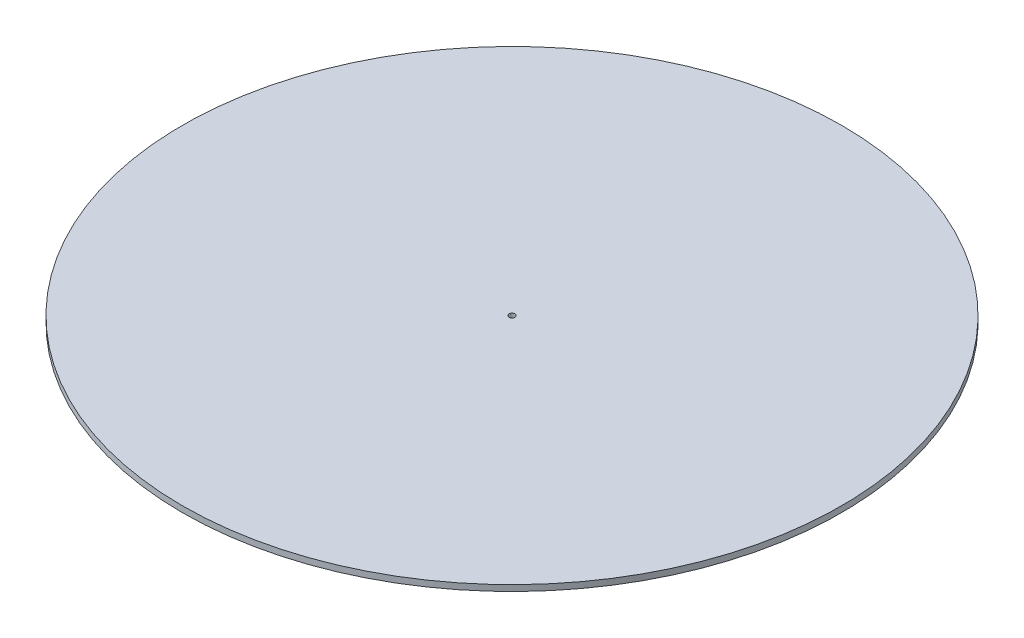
ISO-10303-21;
HEADER;
FILE_DESCRIPTION(('STEP AP214'),'2;1');
FILE_NAME('part.step','',(''),(''),'','','');
FILE_SCHEMA(('AUTOMOTIVE_DESIGN { 1 0 10303 214 1 1 1 1 }'));
ENDSEC;
DATA;
#1=APPLICATION_CONTEXT('core data for automotive mechanical design processes');
#2=APPLICATION_PROTOCOL_DEFINITION('international standard','automotive_design',2000,#1);
#3=PRODUCT_CONTEXT('',#1,'mechanical');
#4=PRODUCT('Part','Part','',(#3));
#5=PRODUCT_RELATED_PRODUCT_CATEGORY('part','',(#4));
#6=PRODUCT_DEFINITION_FORMATION('','',#4);
#7=PRODUCT_DEFINITION_CONTEXT('part definition',#1,'design');
#8=PRODUCT_DEFINITION('design','',#6,#7);
#9=PRODUCT_DEFINITION_SHAPE('','',#8);
#10=(LENGTH_UNIT() NAMED_UNIT(*) SI_UNIT(.MILLI.,.METRE.));
#11=(NAMED_UNIT(*) PLANE_ANGLE_UNIT() SI_UNIT($,.RADIAN.));
#12=(NAMED_UNIT(*) SI_UNIT($,.STERADIAN.) SOLID_ANGLE_UNIT());
#13=UNCERTAINTY_MEASURE_WITH_UNIT(LENGTH_MEASURE(1.E-05),#10,'distance_accuracy_value','');
#14=(GEOMETRIC_REPRESENTATION_CONTEXT(3) GLOBAL_UNCERTAINTY_ASSIGNED_CONTEXT((#13)) GLOBAL_UNIT_ASSIGNED_CONTEXT((#10,
#11,#12)) REPRESENTATION_CONTEXT('',''));
#15=CARTESIAN_POINT('',(0.,0.,0.));
#16=DIRECTION('',(0.,0.,1.));
#17=DIRECTION('',(1.,0.,0.));
#18=AXIS2_PLACEMENT_3D('',#15,#16,#17);
#19=CARTESIAN_POINT('',(0.,10.,0.));
#20=DIRECTION('',(0.,1.,0.));
#21=DIRECTION('',(0.,0.,1.));
#22=AXIS2_PLACEMENT_3D('',#19,#20,#21);
#23=PLANE('',#22);
#24=CARTESIAN_POINT('',(0.,10.,0.));
#25=DIRECTION('',(0.,1.,0.));
#26=DIRECTION('',(0.,0.,1.));
#27=AXIS2_PLACEMENT_3D('',#24,#25,#26);
#28=CIRCLE('',#27,550.);
#29=CARTESIAN_POINT('',(0.,10.,550.));
#30=VERTEX_POINT('',#29);
#31=EDGE_CURVE('E10',#30,#30,#28,.T.);
#32=ORIENTED_EDGE('',*,*,#31,.T.);
#33=EDGE_LOOP('',(#32));
#34=FACE_BOUND('',#33,.T.);
#35=CARTESIAN_POINT('',(0.,10.,0.));
#36=DIRECTION('',(0.,1.,0.));
#37=DIRECTION('',(0.,0.,1.));
#38=AXIS2_PLACEMENT_3D('',#35,#36,#37);
#39=CIRCLE('',#38,5.);
#40=CARTESIAN_POINT('',(0.,10.,5.));
#41=VERTEX_POINT('',#40);
#42=EDGE_CURVE('E45',#41,#41,#39,.T.);
#43=ORIENTED_EDGE('',*,*,#42,.F.);
#44=EDGE_LOOP('',(#43));
#45=FACE_BOUND('',#44,.T.);
#46=ADVANCED_FACE('F34',(#34,#45),#23,.T.);
#47=CARTESIAN_POINT('',(0.,0.,0.));
#48=DIRECTION('',(0.,1.,0.));
#49=DIRECTION('',(0.,0.,1.));
#50=AXIS2_PLACEMENT_3D('',#47,#48,#49);
#51=PLANE('',#50);
#52=CARTESIAN_POINT('',(0.,0.,0.));
#53=DIRECTION('',(0.,1.,0.));
#54=DIRECTION('',(0.,0.,1.));
#55=AXIS2_PLACEMENT_3D('',#52,#53,#54);
#56=CIRCLE('',#55,550.);
#57=CARTESIAN_POINT('',(0.,0.,550.));
#58=VERTEX_POINT('',#57);
#59=EDGE_CURVE('E38',#58,#58,#56,.T.);
#60=ORIENTED_EDGE('',*,*,#59,.F.);
#61=EDGE_LOOP('',(#60));
#62=FACE_BOUND('',#61,.T.);
#63=CARTESIAN_POINT('',(0.,0.,0.));
#64=DIRECTION('',(0.,1.,0.));
#65=DIRECTION('',(0.,0.,1.));
#66=AXIS2_PLACEMENT_3D('',#63,#64,#65);
#67=CIRCLE('',#66,5.);
#68=CARTESIAN_POINT('',(0.,0.,5.));
#69=VERTEX_POINT('',#68);
#70=EDGE_CURVE('E47',#69,#69,#67,.T.);
#71=ORIENTED_EDGE('',*,*,#70,.T.);
#72=EDGE_LOOP('',(#71));
#73=FACE_BOUND('',#72,.T.);
#74=ADVANCED_FACE('F57',(#62,#73),#51,.F.);
#75=CARTESIAN_POINT('',(0.,10.,0.));
#76=DIRECTION('',(0.,-1.,0.));
#77=DIRECTION('',(0.,0.,-1.));
#78=AXIS2_PLACEMENT_3D('',#75,#76,#77);
#79=CYLINDRICAL_SURFACE('',#78,550.);
#80=ORIENTED_EDGE('',*,*,#31,.F.);
#81=EDGE_LOOP('',(#80));
#82=FACE_BOUND('',#81,.T.);
#83=ORIENTED_EDGE('',*,*,#59,.T.);
#84=EDGE_LOOP('',(#83));
#85=FACE_BOUND('',#84,.T.);
#86=ADVANCED_FACE('F36',(#82,#85),#79,.T.);
#87=CARTESIAN_POINT('',(0.,10.,0.));
#88=DIRECTION('',(0.,-1.,0.));
#89=DIRECTION('',(0.,0.,-1.));
#90=AXIS2_PLACEMENT_3D('',#87,#88,#89);
#91=CYLINDRICAL_SURFACE('',#90,5.);
#92=ORIENTED_EDGE('',*,*,#42,.T.);
#93=EDGE_LOOP('',(#92));
#94=FACE_BOUND('',#93,.T.);
#95=ORIENTED_EDGE('',*,*,#70,.F.);
#96=EDGE_LOOP('',(#95));
#97=FACE_BOUND('',#96,.T.);
#98=ADVANCED_FACE('F53',(#94,#97),#91,.F.);
#99=CLOSED_SHELL('',(#46,#74,#86,#98));
#100=MANIFOLD_SOLID_BREP('B2',#99);
#101=ADVANCED_BREP_SHAPE_REPRESENTATION('',(#18,#100),#14);
#102=SHAPE_DEFINITION_REPRESENTATION(#9,#101);
ENDSEC;
END-ISO-10303-21;
